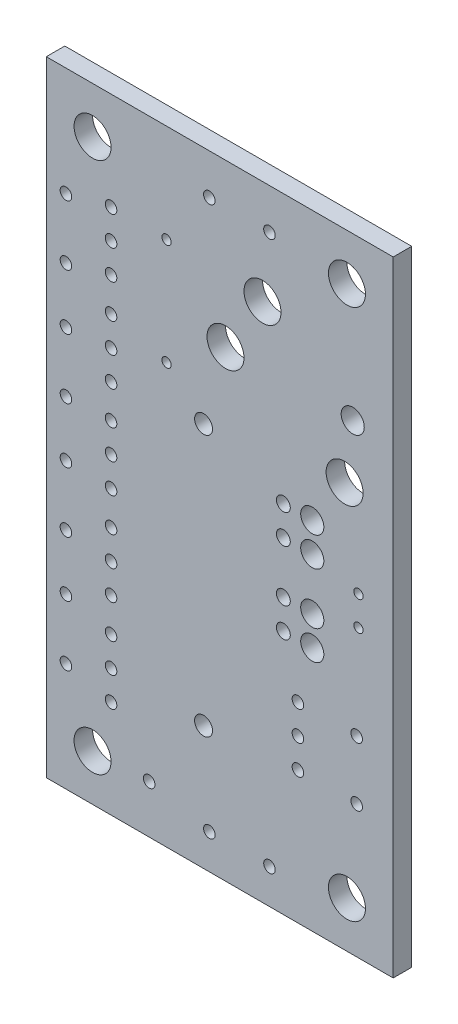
from build123d import *

# Parameters (mm, degrees)
MODEL_W            = 30
MODEL_H            = 54
MODEL_R            = 0.5
MODEL_R_2          = 1.6
MODEL_R_3          = 1
MODEL_R_4          = 0.6
MODEL_R_5          = 0.775
MODEL_R_6          = 0.4
BOSS_EXTRU_1_DEPTH = 1.6


with BuildPart() as part:
    # Model → Boss.-Extru.1 (new body)
    with BuildSketch(Plane.XY):
        with Locations((15, 27)):
            Rectangle(MODEL_W, MODEL_H)
        with Locations((1.7, 39.4)):
            Circle(MODEL_R, mode=Mode.SUBTRACT)
        with Locations((1.7, 44.6)):
            Circle(MODEL_R, mode=Mode.SUBTRACT)
        with Locations((1.7, 29.4)):
            Circle(MODEL_R, mode=Mode.SUBTRACT)
        with Locations((1.7, 34.6)):
            Circle(MODEL_R, mode=Mode.SUBTRACT)
        with Locations((1.7, 19.4)):
            Circle(MODEL_R, mode=Mode.SUBTRACT)
        with Locations((1.7, 24.6)):
            Circle(MODEL_R, mode=Mode.SUBTRACT)
        with Locations((1.7, 9.4)):
            Circle(MODEL_R, mode=Mode.SUBTRACT)
        with Locations((1.7, 14.6)):
            Circle(MODEL_R, mode=Mode.SUBTRACT)
        with Locations((14.1, 50.5)):
            Circle(MODEL_R, mode=Mode.SUBTRACT)
        with Locations((19.3, 50.5)):
            Circle(MODEL_R, mode=Mode.SUBTRACT)
        with Locations((19.3, 3)):
            Circle(MODEL_R, mode=Mode.SUBTRACT)
        with Locations((14.1, 3)):
            Circle(MODEL_R, mode=Mode.SUBTRACT)
        with Locations((5.6, 45.54)):
            Circle(MODEL_R, mode=Mode.SUBTRACT)
        with Locations((5.6, 43)):
            Circle(MODEL_R, mode=Mode.SUBTRACT)
        with Locations((5.6, 40.46)):
            Circle(MODEL_R, mode=Mode.SUBTRACT)
        with Locations((5.6, 37.5217)):
            Circle(MODEL_R, mode=Mode.SUBTRACT)
        with Locations((5.6, 34.9817)):
            Circle(MODEL_R, mode=Mode.SUBTRACT)
        with Locations((5.6, 32.4417)):
            Circle(MODEL_R, mode=Mode.SUBTRACT)
        with Locations((5.6, 29.54)):
            Circle(MODEL_R, mode=Mode.SUBTRACT)
        with Locations((5.6, 27)):
            Circle(MODEL_R, mode=Mode.SUBTRACT)
        with Locations((5.6, 24.46)):
            Circle(MODEL_R, mode=Mode.SUBTRACT)
        with Locations((5.6, 21.54)):
            Circle(MODEL_R, mode=Mode.SUBTRACT)
        with Locations((5.6, 19)):
            Circle(MODEL_R, mode=Mode.SUBTRACT)
        with Locations((5.6, 16.46)):
            Circle(MODEL_R, mode=Mode.SUBTRACT)
        with Locations((5.6, 13.54)):
            Circle(MODEL_R, mode=Mode.SUBTRACT)
        with Locations((5.6, 11)):
            Circle(MODEL_R, mode=Mode.SUBTRACT)
        with Locations((5.6, 8.46)):
            Circle(MODEL_R, mode=Mode.SUBTRACT)
        with Locations((15.498, 39.999)):
            Circle(MODEL_R_2, mode=Mode.SUBTRACT)
        with Locations((18.698, 45)):
            Circle(MODEL_R_2, mode=Mode.SUBTRACT)
        with Locations((25.798, 35)):
            Circle(MODEL_R_2, mode=Mode.SUBTRACT)
        with Locations((26.4983, 39.9992)):
            Circle(MODEL_R_3, mode=Mode.SUBTRACT)
        with Locations((20.5, 28.23)):
            Circle(MODEL_R_4, mode=Mode.SUBTRACT)
        with Locations((20.5, 30.77)):
            Circle(MODEL_R_4, mode=Mode.SUBTRACT)
        with Locations((23, 30.77)):
            Circle(MODEL_R_3, mode=Mode.SUBTRACT)
        with Locations((23, 28.23)):
            Circle(MODEL_R_3, mode=Mode.SUBTRACT)
        with Locations((20.5, 21.23)):
            Circle(MODEL_R_4, mode=Mode.SUBTRACT)
        with Locations((20.5, 23.77)):
            Circle(MODEL_R_4, mode=Mode.SUBTRACT)
        with Locations((23, 23.77)):
            Circle(MODEL_R_3, mode=Mode.SUBTRACT)
        with Locations((23, 21.23)):
            Circle(MODEL_R_3, mode=Mode.SUBTRACT)
        with Locations((13.6, 33.3)):
            Circle(MODEL_R_5, mode=Mode.SUBTRACT)
        with Locations((13.6, 10.7)):
            Circle(MODEL_R_5, mode=Mode.SUBTRACT)
        with Locations((26, 4)):
            Circle(MODEL_R_2, mode=Mode.SUBTRACT)
        with Locations((4, 4)):
            Circle(MODEL_R_2, mode=Mode.SUBTRACT)
        with Locations((26, 50)):
            Circle(MODEL_R_2, mode=Mode.SUBTRACT)
        with Locations((4, 50)):
            Circle(MODEL_R_2, mode=Mode.SUBTRACT)
        with Locations((26.9977, 27.2723)):
            Circle(MODEL_R_6, mode=Mode.SUBTRACT)
        with Locations((26.9977, 24.7323)):
            Circle(MODEL_R_6, mode=Mode.SUBTRACT)
        with Locations((10.4, 45.5)):
            Circle(MODEL_R_6, mode=Mode.SUBTRACT)
        with Locations((10.4, 36.3)):
            Circle(MODEL_R_6, mode=Mode.SUBTRACT)
        with Locations((21.7605, 14)):
            Circle(MODEL_R, mode=Mode.SUBTRACT)
        with Locations((21.7605, 11.46)):
            Circle(MODEL_R, mode=Mode.SUBTRACT)
        with Locations((26.8405, 11.46)):
            Circle(MODEL_R, mode=Mode.SUBTRACT)
        with Locations((26.8405, 16.54)):
            Circle(MODEL_R, mode=Mode.SUBTRACT)
        with Locations((21.7605, 16.54)):
            Circle(MODEL_R, mode=Mode.SUBTRACT)
        with Locations((8.8994, 4.172)):
            Circle(MODEL_R, mode=Mode.SUBTRACT)
    extrude(amount=BOSS_EXTRU_1_DEPTH)


solid = part.part
